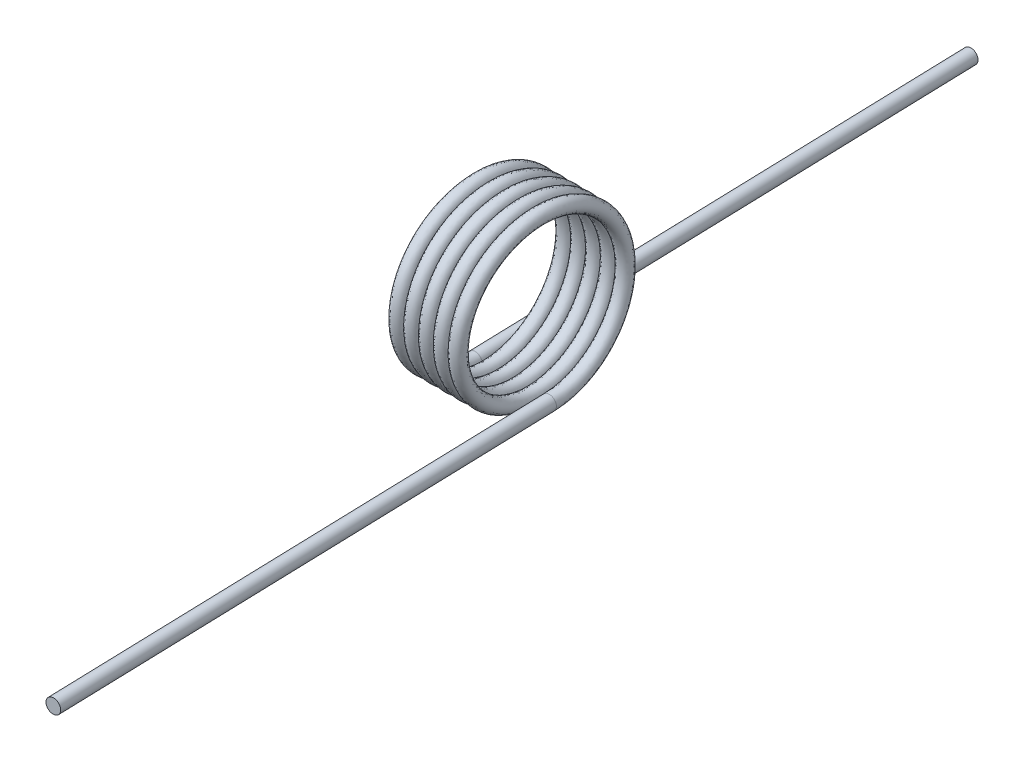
from build123d import *

# Parameters (mm, degrees)
SWEEP1_PITCH       = 0.7366
SWEEP1_HEIGHT      = 3.683
SWEEP1_RADIUS      = 3.9624
SWEEP1_START_ANGLE = 90
SKETCH2_R          = 0.3556
SKETCH3_R          = 0.3556
EXTRUDE1_DEPTH     = 25.4
SKETCH4_R          = 0.3556
EXTRUDE2_DEPTH     = 25.4


with BuildPart() as part:
    # Sweep1: sweep along a helix
    with BuildLine() as sweep1_path:
        add(Helix(SWEEP1_PITCH, SWEEP1_HEIGHT, SWEEP1_RADIUS, center=(0, 0, 0), direction=(1, 0, 0), lefthand=True, mode=Mode.PRIVATE).rotate(Axis((0, 0, 0), (1, 0, 0)), SWEEP1_START_ANGLE))
    # Sketch2 → Sweep1 (sweep)
    with BuildSketch(Plane(origin=(0, -3.9624, 0), x_dir=(0.999562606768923, 2.666497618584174e-14, -0.029573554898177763), z_dir=(0.029573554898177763, -1.1776142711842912e-14, 0.999562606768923))):
        Circle(SKETCH2_R)
    sweep(path=sweep1_path.line, is_frenet=True)

    # Sketch3 → Extrude1 (add)
    with BuildSketch(Plane(origin=(0, 0, 0), x_dir=(-0.999562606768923, -2.6637223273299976e-14, 0.029573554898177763), z_dir=(-0.029573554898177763, 1.177614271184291e-14, -0.999562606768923))):
        with Locations(Location((0, -3.9624, 0), (0, 0, 180))):
            Circle(SKETCH3_R)
    extrude(amount=EXTRUDE1_DEPTH)

    # Sketch4 → Extrude2 (add)
    with BuildSketch(Plane(origin=(0.003221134, 0, 0.108871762), x_dir=(0.9958935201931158, -0.08560321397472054, -0.02946499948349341), z_dir=(0.02957355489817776, 5.802172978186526e-14, 0.9995626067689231))):
        with Locations(Location((4.00707001, -3.632716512, 0), (0, 0, 4.910712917))):
            Circle(SKETCH4_R)
    extrude(amount=EXTRUDE2_DEPTH)


solid = part.part
